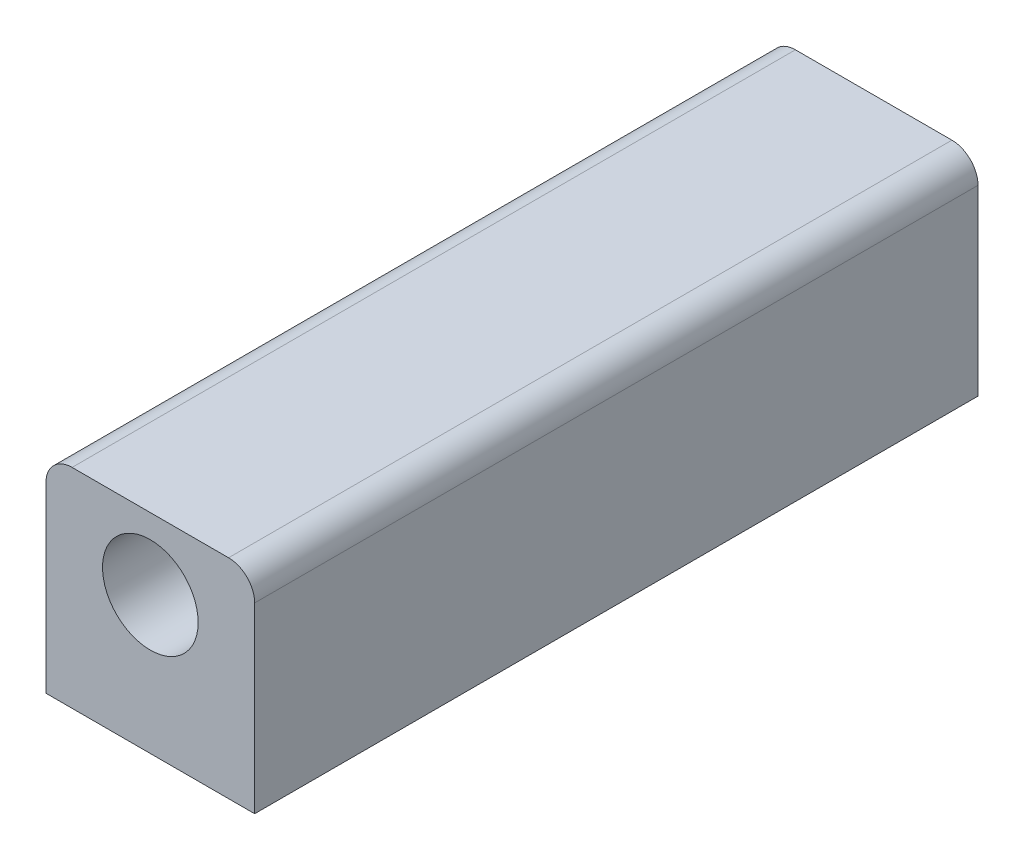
ISO-10303-21;
HEADER;
FILE_DESCRIPTION(('STEP AP214'),'2;1');
FILE_NAME('part.step','',(''),(''),'','','');
FILE_SCHEMA(('AUTOMOTIVE_DESIGN { 1 0 10303 214 1 1 1 1 }'));
ENDSEC;
DATA;
#1=APPLICATION_CONTEXT('core data for automotive mechanical design processes');
#2=APPLICATION_PROTOCOL_DEFINITION('international standard','automotive_design',2000,#1);
#3=PRODUCT_CONTEXT('',#1,'mechanical');
#4=PRODUCT('Part','Part','',(#3));
#5=PRODUCT_RELATED_PRODUCT_CATEGORY('part','',(#4));
#6=PRODUCT_DEFINITION_FORMATION('','',#4);
#7=PRODUCT_DEFINITION_CONTEXT('part definition',#1,'design');
#8=PRODUCT_DEFINITION('design','',#6,#7);
#9=PRODUCT_DEFINITION_SHAPE('','',#8);
#10=(LENGTH_UNIT() NAMED_UNIT(*) SI_UNIT(.MILLI.,.METRE.));
#11=(NAMED_UNIT(*) PLANE_ANGLE_UNIT() SI_UNIT($,.RADIAN.));
#12=(NAMED_UNIT(*) SI_UNIT($,.STERADIAN.) SOLID_ANGLE_UNIT());
#13=UNCERTAINTY_MEASURE_WITH_UNIT(LENGTH_MEASURE(1.E-05),#10,'distance_accuracy_value','');
#14=(GEOMETRIC_REPRESENTATION_CONTEXT(3) GLOBAL_UNCERTAINTY_ASSIGNED_CONTEXT((#13)) GLOBAL_UNIT_ASSIGNED_CONTEXT((#10,
#11,#12)) REPRESENTATION_CONTEXT('',''));
#15=CARTESIAN_POINT('',(0.,0.,0.));
#16=DIRECTION('',(0.,0.,1.));
#17=DIRECTION('',(1.,0.,0.));
#18=AXIS2_PLACEMENT_3D('',#15,#16,#17);
#19=CARTESIAN_POINT('',(9.,5.2,83.2));
#20=DIRECTION('',(0.,0.,-1.));
#21=DIRECTION('',(-1.,0.,0.));
#22=AXIS2_PLACEMENT_3D('',#19,#20,#21);
#23=PLANE('',#22);
#24=CARTESIAN_POINT('',(9.,5.2,83.2));
#25=DIRECTION('',(0.,0.,1.));
#26=DIRECTION('',(-1.,0.,0.));
#27=AXIS2_PLACEMENT_3D('',#24,#25,#26);
#28=CIRCLE('',#27,3.);
#29=CARTESIAN_POINT('',(12.,5.2,83.2));
#30=VERTEX_POINT('',#29);
#31=CARTESIAN_POINT('',(9.,8.2,83.2));
#32=VERTEX_POINT('',#31);
#33=EDGE_CURVE('E127',#30,#32,#28,.T.);
#34=ORIENTED_EDGE('',*,*,#33,.T.);
#35=DIRECTION('',(-1.,0.,0.));
#36=VECTOR('',#35,1.);
#37=CARTESIAN_POINT('',(-9.,8.2,83.2));
#38=LINE('',#37,#36);
#39=CARTESIAN_POINT('',(-9.,8.2,83.2));
#40=VERTEX_POINT('',#39);
#41=EDGE_CURVE('E85',#32,#40,#38,.T.);
#42=ORIENTED_EDGE('',*,*,#41,.T.);
#43=CARTESIAN_POINT('',(-9.,5.2,83.2));
#44=DIRECTION('',(0.,0.,1.));
#45=DIRECTION('',(1.,0.,0.));
#46=AXIS2_PLACEMENT_3D('',#43,#44,#45);
#47=CIRCLE('',#46,3.);
#48=CARTESIAN_POINT('',(-12.,5.2,83.2));
#49=VERTEX_POINT('',#48);
#50=EDGE_CURVE('E98',#40,#49,#47,.T.);
#51=ORIENTED_EDGE('',*,*,#50,.T.);
#52=DIRECTION('',(0.,-1.,0.));
#53=VECTOR('',#52,1.);
#54=CARTESIAN_POINT('',(-12.,5.2,83.2));
#55=LINE('',#54,#53);
#56=CARTESIAN_POINT('',(-12.,-15.8,83.2));
#57=VERTEX_POINT('',#56);
#58=EDGE_CURVE('E92',#49,#57,#55,.T.);
#59=ORIENTED_EDGE('',*,*,#58,.T.);
#60=DIRECTION('',(1.,0.,0.));
#61=VECTOR('',#60,1.);
#62=CARTESIAN_POINT('',(-12.,-15.8,83.2));
#63=LINE('',#62,#61);
#64=CARTESIAN_POINT('',(12.,-15.8,83.2));
#65=VERTEX_POINT('',#64);
#66=EDGE_CURVE('E96',#57,#65,#63,.T.);
#67=ORIENTED_EDGE('',*,*,#66,.T.);
#68=DIRECTION('',(0.,1.,0.));
#69=VECTOR('',#68,1.);
#70=CARTESIAN_POINT('',(12.,5.2,83.2));
#71=LINE('',#70,#69);
#72=EDGE_CURVE('E48',#65,#30,#71,.T.);
#73=ORIENTED_EDGE('',*,*,#72,.T.);
#74=EDGE_LOOP('',(#34,#42,#51,#59,#67,#73));
#75=FACE_BOUND('',#74,.T.);
#76=CARTESIAN_POINT('',(0.,0.,83.2));
#77=DIRECTION('',(0.,0.,1.));
#78=DIRECTION('',(1.,0.,0.));
#79=AXIS2_PLACEMENT_3D('',#76,#77,#78);
#80=CIRCLE('',#79,5.5);
#81=CARTESIAN_POINT('',(5.5,0.,83.2));
#82=VERTEX_POINT('',#81);
#83=EDGE_CURVE('E120',#82,#82,#80,.T.);
#84=ORIENTED_EDGE('',*,*,#83,.F.);
#85=EDGE_LOOP('',(#84));
#86=FACE_BOUND('',#85,.T.);
#87=ADVANCED_FACE('F31',(#75,#86),#23,.F.);
#88=CARTESIAN_POINT('',(9.,5.2,0.));
#89=DIRECTION('',(0.,0.,-1.));
#90=DIRECTION('',(-1.,0.,0.));
#91=AXIS2_PLACEMENT_3D('',#88,#89,#90);
#92=PLANE('',#91);
#93=CARTESIAN_POINT('',(9.,5.2,0.));
#94=DIRECTION('',(0.,0.,1.));
#95=DIRECTION('',(-1.,0.,0.));
#96=AXIS2_PLACEMENT_3D('',#93,#94,#95);
#97=CIRCLE('',#96,3.);
#98=CARTESIAN_POINT('',(12.,5.2,0.));
#99=VERTEX_POINT('',#98);
#100=CARTESIAN_POINT('',(9.,8.2,0.));
#101=VERTEX_POINT('',#100);
#102=EDGE_CURVE('E116',#99,#101,#97,.T.);
#103=ORIENTED_EDGE('',*,*,#102,.F.);
#104=DIRECTION('',(0.,1.,0.));
#105=VECTOR('',#104,1.);
#106=CARTESIAN_POINT('',(12.,5.2,0.));
#107=LINE('',#106,#105);
#108=CARTESIAN_POINT('',(12.,-15.8,0.));
#109=VERTEX_POINT('',#108);
#110=EDGE_CURVE('E77',#109,#99,#107,.T.);
#111=ORIENTED_EDGE('',*,*,#110,.F.);
#112=DIRECTION('',(1.,0.,0.));
#113=VECTOR('',#112,1.);
#114=CARTESIAN_POINT('',(-12.,-15.8,0.));
#115=LINE('',#114,#113);
#116=CARTESIAN_POINT('',(-12.,-15.8,0.));
#117=VERTEX_POINT('',#116);
#118=EDGE_CURVE('E71',#117,#109,#115,.T.);
#119=ORIENTED_EDGE('',*,*,#118,.F.);
#120=DIRECTION('',(0.,-1.,0.));
#121=VECTOR('',#120,1.);
#122=CARTESIAN_POINT('',(-12.,5.2,0.));
#123=LINE('',#122,#121);
#124=CARTESIAN_POINT('',(-12.,5.2,0.));
#125=VERTEX_POINT('',#124);
#126=EDGE_CURVE('E106',#125,#117,#123,.T.);
#127=ORIENTED_EDGE('',*,*,#126,.F.);
#128=CARTESIAN_POINT('',(-9.,5.2,0.));
#129=DIRECTION('',(0.,0.,1.));
#130=DIRECTION('',(1.,0.,0.));
#131=AXIS2_PLACEMENT_3D('',#128,#129,#130);
#132=CIRCLE('',#131,3.);
#133=CARTESIAN_POINT('',(-9.,8.2,0.));
#134=VERTEX_POINT('',#133);
#135=EDGE_CURVE('E122',#134,#125,#132,.T.);
#136=ORIENTED_EDGE('',*,*,#135,.F.);
#137=DIRECTION('',(-1.,0.,0.));
#138=VECTOR('',#137,1.);
#139=CARTESIAN_POINT('',(-9.,8.2,0.));
#140=LINE('',#139,#138);
#141=EDGE_CURVE('E119',#101,#134,#140,.T.);
#142=ORIENTED_EDGE('',*,*,#141,.F.);
#143=EDGE_LOOP('',(#103,#111,#119,#127,#136,#142));
#144=FACE_BOUND('',#143,.T.);
#145=CARTESIAN_POINT('',(0.,0.,0.));
#146=DIRECTION('',(0.,0.,1.));
#147=DIRECTION('',(1.,0.,0.));
#148=AXIS2_PLACEMENT_3D('',#145,#146,#147);
#149=CIRCLE('',#148,5.5);
#150=CARTESIAN_POINT('',(5.5,0.,0.));
#151=VERTEX_POINT('',#150);
#152=EDGE_CURVE('E220',#151,#151,#149,.T.);
#153=ORIENTED_EDGE('',*,*,#152,.T.);
#154=EDGE_LOOP('',(#153));
#155=FACE_BOUND('',#154,.T.);
#156=ADVANCED_FACE('F136',(#144,#155),#92,.T.);
#157=CARTESIAN_POINT('',(9.,5.2,83.2));
#158=DIRECTION('',(0.,0.,-1.));
#159=DIRECTION('',(-1.,0.,0.));
#160=AXIS2_PLACEMENT_3D('',#157,#158,#159);
#161=CYLINDRICAL_SURFACE('',#160,3.);
#162=ORIENTED_EDGE('',*,*,#102,.T.);
#163=DIRECTION('',(0.,0.,-1.));
#164=VECTOR('',#163,1.);
#165=CARTESIAN_POINT('',(9.,8.2,83.2));
#166=LINE('',#165,#164);
#167=EDGE_CURVE('E11',#32,#101,#166,.T.);
#168=ORIENTED_EDGE('',*,*,#167,.F.);
#169=ORIENTED_EDGE('',*,*,#33,.F.);
#170=DIRECTION('',(0.,0.,-1.));
#171=VECTOR('',#170,1.);
#172=CARTESIAN_POINT('',(12.,5.2,83.2));
#173=LINE('',#172,#171);
#174=EDGE_CURVE('E112',#30,#99,#173,.T.);
#175=ORIENTED_EDGE('',*,*,#174,.T.);
#176=EDGE_LOOP('',(#162,#168,#169,#175));
#177=FACE_BOUND('',#176,.T.);
#178=ADVANCED_FACE('F33',(#177),#161,.T.);
#179=CARTESIAN_POINT('',(-9.,8.2,83.2));
#180=DIRECTION('',(0.,-1.,0.));
#181=DIRECTION('',(0.,0.,-1.));
#182=AXIS2_PLACEMENT_3D('',#179,#180,#181);
#183=PLANE('',#182);
#184=ORIENTED_EDGE('',*,*,#141,.T.);
#185=DIRECTION('',(0.,0.,-1.));
#186=VECTOR('',#185,1.);
#187=CARTESIAN_POINT('',(-9.,8.2,83.2));
#188=LINE('',#187,#186);
#189=EDGE_CURVE('E40',#40,#134,#188,.T.);
#190=ORIENTED_EDGE('',*,*,#189,.F.);
#191=ORIENTED_EDGE('',*,*,#41,.F.);
#192=ORIENTED_EDGE('',*,*,#167,.T.);
#193=EDGE_LOOP('',(#184,#190,#191,#192));
#194=FACE_BOUND('',#193,.T.);
#195=ADVANCED_FACE('F161',(#194),#183,.F.);
#196=CARTESIAN_POINT('',(-9.,5.2,83.2));
#197=DIRECTION('',(0.,0.,-1.));
#198=DIRECTION('',(-1.,0.,0.));
#199=AXIS2_PLACEMENT_3D('',#196,#197,#198);
#200=CYLINDRICAL_SURFACE('',#199,3.);
#201=ORIENTED_EDGE('',*,*,#135,.T.);
#202=DIRECTION('',(0.,0.,-1.));
#203=VECTOR('',#202,1.);
#204=CARTESIAN_POINT('',(-12.,5.2,83.2));
#205=LINE('',#204,#203);
#206=EDGE_CURVE('E107',#49,#125,#205,.T.);
#207=ORIENTED_EDGE('',*,*,#206,.F.);
#208=ORIENTED_EDGE('',*,*,#50,.F.);
#209=ORIENTED_EDGE('',*,*,#189,.T.);
#210=EDGE_LOOP('',(#201,#207,#208,#209));
#211=FACE_BOUND('',#210,.T.);
#212=ADVANCED_FACE('F133',(#211),#200,.T.);
#213=CARTESIAN_POINT('',(-12.,5.2,83.2));
#214=DIRECTION('',(1.,0.,0.));
#215=DIRECTION('',(0.,1.,0.));
#216=AXIS2_PLACEMENT_3D('',#213,#214,#215);
#217=PLANE('',#216);
#218=ORIENTED_EDGE('',*,*,#126,.T.);
#219=DIRECTION('',(0.,0.,-1.));
#220=VECTOR('',#219,1.);
#221=CARTESIAN_POINT('',(-12.,-15.8,83.2));
#222=LINE('',#221,#220);
#223=EDGE_CURVE('E103',#57,#117,#222,.T.);
#224=ORIENTED_EDGE('',*,*,#223,.F.);
#225=ORIENTED_EDGE('',*,*,#58,.F.);
#226=ORIENTED_EDGE('',*,*,#206,.T.);
#227=EDGE_LOOP('',(#218,#224,#225,#226));
#228=FACE_BOUND('',#227,.T.);
#229=ADVANCED_FACE('F104',(#228),#217,.F.);
#230=CARTESIAN_POINT('',(-12.,-15.8,83.2));
#231=DIRECTION('',(0.,1.,0.));
#232=DIRECTION('',(0.,0.,1.));
#233=AXIS2_PLACEMENT_3D('',#230,#231,#232);
#234=PLANE('',#233);
#235=ORIENTED_EDGE('',*,*,#118,.T.);
#236=DIRECTION('',(0.,0.,-1.));
#237=VECTOR('',#236,1.);
#238=CARTESIAN_POINT('',(12.,-15.8,83.2));
#239=LINE('',#238,#237);
#240=EDGE_CURVE('E108',#65,#109,#239,.T.);
#241=ORIENTED_EDGE('',*,*,#240,.F.);
#242=ORIENTED_EDGE('',*,*,#66,.F.);
#243=ORIENTED_EDGE('',*,*,#223,.T.);
#244=EDGE_LOOP('',(#235,#241,#242,#243));
#245=FACE_BOUND('',#244,.T.);
#246=ADVANCED_FACE('F110',(#245),#234,.F.);
#247=CARTESIAN_POINT('',(12.,5.2,83.2));
#248=DIRECTION('',(-1.,0.,0.));
#249=DIRECTION('',(0.,-1.,0.));
#250=AXIS2_PLACEMENT_3D('',#247,#248,#249);
#251=PLANE('',#250);
#252=ORIENTED_EDGE('',*,*,#110,.T.);
#253=ORIENTED_EDGE('',*,*,#174,.F.);
#254=ORIENTED_EDGE('',*,*,#72,.F.);
#255=ORIENTED_EDGE('',*,*,#240,.T.);
#256=EDGE_LOOP('',(#252,#253,#254,#255));
#257=FACE_BOUND('',#256,.T.);
#258=ADVANCED_FACE('F141',(#257),#251,.F.);
#259=CARTESIAN_POINT('',(0.,0.,83.2));
#260=DIRECTION('',(0.,0.,-1.));
#261=DIRECTION('',(-1.,0.,0.));
#262=AXIS2_PLACEMENT_3D('',#259,#260,#261);
#263=CYLINDRICAL_SURFACE('',#262,5.5);
#264=ORIENTED_EDGE('',*,*,#83,.T.);
#265=EDGE_LOOP('',(#264));
#266=FACE_BOUND('',#265,.T.);
#267=ORIENTED_EDGE('',*,*,#152,.F.);
#268=EDGE_LOOP('',(#267));
#269=FACE_BOUND('',#268,.T.);
#270=ADVANCED_FACE('F143',(#266,#269),#263,.F.);
#271=CLOSED_SHELL('',(#87,#156,#178,#195,#212,#229,#246,#258,#270));
#272=MANIFOLD_SOLID_BREP('B2',#271);
#273=ADVANCED_BREP_SHAPE_REPRESENTATION('',(#18,#272),#14);
#274=SHAPE_DEFINITION_REPRESENTATION(#9,#273);
ENDSEC;
END-ISO-10303-21;
